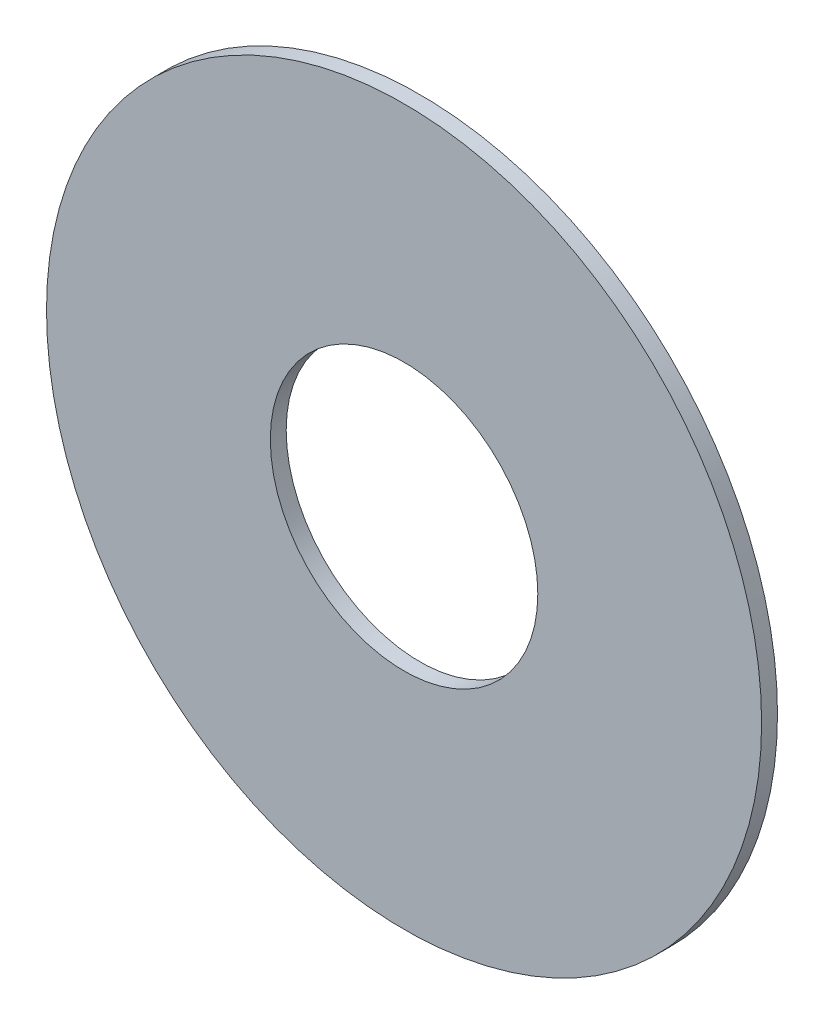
ISO-10303-21;
HEADER;
FILE_DESCRIPTION(('STEP AP214'),'2;1');
FILE_NAME('part.step','',(''),(''),'','','');
FILE_SCHEMA(('AUTOMOTIVE_DESIGN { 1 0 10303 214 1 1 1 1 }'));
ENDSEC;
DATA;
#1=APPLICATION_CONTEXT('core data for automotive mechanical design processes');
#2=APPLICATION_PROTOCOL_DEFINITION('international standard','automotive_design',2000,#1);
#3=PRODUCT_CONTEXT('',#1,'mechanical');
#4=PRODUCT('Part','Part','',(#3));
#5=PRODUCT_RELATED_PRODUCT_CATEGORY('part','',(#4));
#6=PRODUCT_DEFINITION_FORMATION('','',#4);
#7=PRODUCT_DEFINITION_CONTEXT('part definition',#1,'design');
#8=PRODUCT_DEFINITION('design','',#6,#7);
#9=PRODUCT_DEFINITION_SHAPE('','',#8);
#10=(LENGTH_UNIT() NAMED_UNIT(*) SI_UNIT(.MILLI.,.METRE.));
#11=(NAMED_UNIT(*) PLANE_ANGLE_UNIT() SI_UNIT($,.RADIAN.));
#12=(NAMED_UNIT(*) SI_UNIT($,.STERADIAN.) SOLID_ANGLE_UNIT());
#13=UNCERTAINTY_MEASURE_WITH_UNIT(LENGTH_MEASURE(1.E-05),#10,'distance_accuracy_value','');
#14=(GEOMETRIC_REPRESENTATION_CONTEXT(3) GLOBAL_UNCERTAINTY_ASSIGNED_CONTEXT((#13)) GLOBAL_UNIT_ASSIGNED_CONTEXT((#10,
#11,#12)) REPRESENTATION_CONTEXT('',''));
#15=CARTESIAN_POINT('',(0.,0.,0.));
#16=DIRECTION('',(0.,0.,1.));
#17=DIRECTION('',(1.,0.,0.));
#18=AXIS2_PLACEMENT_3D('',#15,#16,#17);
#19=CARTESIAN_POINT('',(0.,0.,0.762));
#20=DIRECTION('',(0.,0.,1.));
#21=DIRECTION('',(1.,0.,0.));
#22=AXIS2_PLACEMENT_3D('',#19,#20,#21);
#23=PLANE('',#22);
#24=CARTESIAN_POINT('',(0.,0.,0.762));
#25=DIRECTION('',(0.,0.,1.));
#26=DIRECTION('',(1.,0.,0.));
#27=AXIS2_PLACEMENT_3D('',#24,#25,#26);
#28=CIRCLE('',#27,17.145);
#29=CARTESIAN_POINT('',(-17.145,0.,0.762));
#30=VERTEX_POINT('',#29);
#31=EDGE_CURVE('E10',#30,#30,#28,.T.);
#32=ORIENTED_EDGE('',*,*,#31,.T.);
#33=EDGE_LOOP('',(#32));
#34=FACE_BOUND('',#33,.T.);
#35=CARTESIAN_POINT('',(0.,0.,0.762));
#36=DIRECTION('',(0.,0.,1.));
#37=DIRECTION('',(1.,0.,0.));
#38=AXIS2_PLACEMENT_3D('',#35,#36,#37);
#39=CIRCLE('',#38,6.4135);
#40=CARTESIAN_POINT('',(-6.4135,0.,0.762));
#41=VERTEX_POINT('',#40);
#42=EDGE_CURVE('E48',#41,#41,#39,.T.);
#43=ORIENTED_EDGE('',*,*,#42,.F.);
#44=EDGE_LOOP('',(#43));
#45=FACE_BOUND('',#44,.T.);
#46=ADVANCED_FACE('F37',(#34,#45),#23,.T.);
#47=CARTESIAN_POINT('',(0.,0.,0.));
#48=DIRECTION('',(0.,0.,1.));
#49=DIRECTION('',(1.,0.,0.));
#50=AXIS2_PLACEMENT_3D('',#47,#48,#49);
#51=PLANE('',#50);
#52=CARTESIAN_POINT('',(0.,0.,0.));
#53=DIRECTION('',(0.,0.,1.));
#54=DIRECTION('',(1.,0.,0.));
#55=AXIS2_PLACEMENT_3D('',#52,#53,#54);
#56=CIRCLE('',#55,17.145);
#57=CARTESIAN_POINT('',(-17.145,0.,0.));
#58=VERTEX_POINT('',#57);
#59=EDGE_CURVE('E44',#58,#58,#56,.T.);
#60=ORIENTED_EDGE('',*,*,#59,.F.);
#61=EDGE_LOOP('',(#60));
#62=FACE_BOUND('',#61,.T.);
#63=CARTESIAN_POINT('',(0.,0.,0.));
#64=DIRECTION('',(0.,0.,1.));
#65=DIRECTION('',(1.,0.,0.));
#66=AXIS2_PLACEMENT_3D('',#63,#64,#65);
#67=CIRCLE('',#66,6.4135);
#68=CARTESIAN_POINT('',(-6.4135,0.,0.));
#69=VERTEX_POINT('',#68);
#70=EDGE_CURVE('E52',#69,#69,#67,.T.);
#71=ORIENTED_EDGE('',*,*,#70,.T.);
#72=EDGE_LOOP('',(#71));
#73=FACE_BOUND('',#72,.T.);
#74=ADVANCED_FACE('F58',(#62,#73),#51,.F.);
#75=CARTESIAN_POINT('',(0.,0.,0.762));
#76=DIRECTION('',(0.,0.,-1.));
#77=DIRECTION('',(-1.,0.,0.));
#78=AXIS2_PLACEMENT_3D('',#75,#76,#77);
#79=CYLINDRICAL_SURFACE('',#78,17.145);
#80=CARTESIAN_POINT('',(-17.145,0.,0.762));
#81=CARTESIAN_POINT('',(-17.145,0.,0.7540625));
#82=CARTESIAN_POINT('',(-17.145,0.,0.746125));
#83=CARTESIAN_POINT('',(-17.145,0.,0.73025));
#84=CARTESIAN_POINT('',(-17.145,0.,0.7223125));
#85=CARTESIAN_POINT('',(-17.145,0.,0.7064375));
#86=CARTESIAN_POINT('',(-17.145,0.,0.6985));
#87=CARTESIAN_POINT('',(-17.145,0.,0.682625));
#88=CARTESIAN_POINT('',(-17.145,0.,0.6746875));
#89=CARTESIAN_POINT('',(-17.145,0.,0.6588125));
#90=CARTESIAN_POINT('',(-17.145,0.,0.650875));
#91=CARTESIAN_POINT('',(-17.145,0.,0.635));
#92=CARTESIAN_POINT('',(-17.145,0.,0.6270625));
#93=CARTESIAN_POINT('',(-17.145,0.,0.6111875));
#94=CARTESIAN_POINT('',(-17.145,0.,0.60325));
#95=CARTESIAN_POINT('',(-17.145,0.,0.587375));
#96=CARTESIAN_POINT('',(-17.145,0.,0.5794375));
#97=CARTESIAN_POINT('',(-17.145,0.,0.5635625));
#98=CARTESIAN_POINT('',(-17.145,0.,0.555625));
#99=CARTESIAN_POINT('',(-17.145,0.,0.53975));
#100=CARTESIAN_POINT('',(-17.145,0.,0.5318125));
#101=CARTESIAN_POINT('',(-17.145,0.,0.5159375));
#102=CARTESIAN_POINT('',(-17.145,0.,0.508));
#103=CARTESIAN_POINT('',(-17.145,0.,0.492125));
#104=CARTESIAN_POINT('',(-17.145,0.,0.4841875));
#105=CARTESIAN_POINT('',(-17.145,0.,0.4683125));
#106=CARTESIAN_POINT('',(-17.145,0.,0.460375));
#107=CARTESIAN_POINT('',(-17.145,0.,0.4445));
#108=CARTESIAN_POINT('',(-17.145,0.,0.4365625));
#109=CARTESIAN_POINT('',(-17.145,0.,0.4206875));
#110=CARTESIAN_POINT('',(-17.145,0.,0.41275));
#111=CARTESIAN_POINT('',(-17.145,0.,0.396875));
#112=CARTESIAN_POINT('',(-17.145,0.,0.3889375));
#113=CARTESIAN_POINT('',(-17.145,0.,0.3730625));
#114=CARTESIAN_POINT('',(-17.145,0.,0.365125));
#115=CARTESIAN_POINT('',(-17.145,0.,0.34925));
#116=CARTESIAN_POINT('',(-17.145,0.,0.3413125));
#117=CARTESIAN_POINT('',(-17.145,0.,0.3254375));
#118=CARTESIAN_POINT('',(-17.145,0.,0.3175));
#119=CARTESIAN_POINT('',(-17.145,0.,0.301625));
#120=CARTESIAN_POINT('',(-17.145,0.,0.2936875));
#121=CARTESIAN_POINT('',(-17.145,0.,0.2778125));
#122=CARTESIAN_POINT('',(-17.145,0.,0.269875));
#123=CARTESIAN_POINT('',(-17.145,0.,0.254));
#124=CARTESIAN_POINT('',(-17.145,0.,0.2460625));
#125=CARTESIAN_POINT('',(-17.145,0.,0.2301875));
#126=CARTESIAN_POINT('',(-17.145,0.,0.22225));
#127=CARTESIAN_POINT('',(-17.145,0.,0.206375));
#128=CARTESIAN_POINT('',(-17.145,0.,0.1984375));
#129=CARTESIAN_POINT('',(-17.145,0.,0.1825625));
#130=CARTESIAN_POINT('',(-17.145,0.,0.174625));
#131=CARTESIAN_POINT('',(-17.145,0.,0.15875));
#132=CARTESIAN_POINT('',(-17.145,0.,0.1508125));
#133=CARTESIAN_POINT('',(-17.145,0.,0.1349375));
#134=CARTESIAN_POINT('',(-17.145,0.,0.127));
#135=CARTESIAN_POINT('',(-17.145,0.,0.111125));
#136=CARTESIAN_POINT('',(-17.145,0.,0.1031875));
#137=CARTESIAN_POINT('',(-17.145,0.,0.0873125));
#138=CARTESIAN_POINT('',(-17.145,0.,0.079375));
#139=CARTESIAN_POINT('',(-17.145,0.,0.0635));
#140=CARTESIAN_POINT('',(-17.145,0.,0.0555625));
#141=CARTESIAN_POINT('',(-17.145,0.,0.0396875));
#142=CARTESIAN_POINT('',(-17.145,0.,0.03175));
#143=CARTESIAN_POINT('',(-17.145,0.,0.015875));
#144=CARTESIAN_POINT('',(-17.145,0.,0.00793749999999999));
#145=CARTESIAN_POINT('',(-17.145,0.,0.));
#146=B_SPLINE_CURVE_WITH_KNOTS('',3,(#80,#81,#82,#83,#84,#85,#86,#87,#88,#89,#90,#91,#92,#93,
#94,#95,#96,#97,#98,#99,#100,#101,#102,#103,#104,#105,#106,#107,#108,#109,#110,#111,#112,#113,
#114,#115,#116,#117,#118,#119,#120,#121,#122,#123,#124,#125,#126,#127,#128,#129,#130,#131,#132,
#133,#134,#135,#136,#137,#138,#139,#140,#141,#142,#143,#144,#145),.UNSPECIFIED.,.F.,.F.,(4,2,2,
2,2,2,2,2,2,2,2,2,2,2,2,2,2,2,2,2,2,2,2,2,2,2,2,2,2,2,2,2,4),(0.,0.0238125,0.0476249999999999,
0.0714374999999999,0.09525,0.1190625,0.142875,0.1666875,0.1905,0.2143125,0.238125,0.2619375,
0.28575,0.3095625,0.333375,0.3571875,0.381,0.4048125,0.428625,0.4524375,0.47625,0.5000625,
0.523875,0.5476875,0.5715,0.5953125,0.619125,0.6429375,0.66675,0.6905625,0.714375,0.7381875,
0.762),.UNSPECIFIED.);
#147=EDGE_CURVE('BSEAM39',#30,#58,#146,.T.);
#148=ORIENTED_EDGE('',*,*,#31,.F.);
#149=ORIENTED_EDGE('',*,*,#59,.T.);
#150=ORIENTED_EDGE('',*,*,#147,.T.);
#151=ORIENTED_EDGE('',*,*,#147,.F.);
#152=EDGE_LOOP('',(#148,#150,#149,#151));
#153=FACE_BOUND('',#152,.T.);
#154=ADVANCED_FACE('F39',(#153),#79,.T.);
#155=CARTESIAN_POINT('',(0.,0.,0.762));
#156=DIRECTION('',(0.,0.,-1.));
#157=DIRECTION('',(-1.,0.,0.));
#158=AXIS2_PLACEMENT_3D('',#155,#156,#157);
#159=CYLINDRICAL_SURFACE('',#158,6.4135);
#160=CARTESIAN_POINT('',(-6.4135,0.,0.762));
#161=CARTESIAN_POINT('',(-6.4135,0.,0.7540625));
#162=CARTESIAN_POINT('',(-6.4135,0.,0.746125));
#163=CARTESIAN_POINT('',(-6.4135,0.,0.73025));
#164=CARTESIAN_POINT('',(-6.4135,0.,0.7223125));
#165=CARTESIAN_POINT('',(-6.4135,0.,0.7064375));
#166=CARTESIAN_POINT('',(-6.4135,0.,0.6985));
#167=CARTESIAN_POINT('',(-6.4135,0.,0.682625));
#168=CARTESIAN_POINT('',(-6.4135,0.,0.6746875));
#169=CARTESIAN_POINT('',(-6.4135,0.,0.6588125));
#170=CARTESIAN_POINT('',(-6.4135,0.,0.650875));
#171=CARTESIAN_POINT('',(-6.4135,0.,0.635));
#172=CARTESIAN_POINT('',(-6.4135,0.,0.6270625));
#173=CARTESIAN_POINT('',(-6.4135,0.,0.6111875));
#174=CARTESIAN_POINT('',(-6.4135,0.,0.60325));
#175=CARTESIAN_POINT('',(-6.4135,0.,0.587375));
#176=CARTESIAN_POINT('',(-6.4135,0.,0.5794375));
#177=CARTESIAN_POINT('',(-6.4135,0.,0.5635625));
#178=CARTESIAN_POINT('',(-6.4135,0.,0.555625));
#179=CARTESIAN_POINT('',(-6.4135,0.,0.53975));
#180=CARTESIAN_POINT('',(-6.4135,0.,0.5318125));
#181=CARTESIAN_POINT('',(-6.4135,0.,0.5159375));
#182=CARTESIAN_POINT('',(-6.4135,0.,0.508));
#183=CARTESIAN_POINT('',(-6.4135,0.,0.492125));
#184=CARTESIAN_POINT('',(-6.4135,0.,0.4841875));
#185=CARTESIAN_POINT('',(-6.4135,0.,0.4683125));
#186=CARTESIAN_POINT('',(-6.4135,0.,0.460375));
#187=CARTESIAN_POINT('',(-6.4135,0.,0.4445));
#188=CARTESIAN_POINT('',(-6.4135,0.,0.4365625));
#189=CARTESIAN_POINT('',(-6.4135,0.,0.4206875));
#190=CARTESIAN_POINT('',(-6.4135,0.,0.41275));
#191=CARTESIAN_POINT('',(-6.4135,0.,0.396875));
#192=CARTESIAN_POINT('',(-6.4135,0.,0.3889375));
#193=CARTESIAN_POINT('',(-6.4135,0.,0.3730625));
#194=CARTESIAN_POINT('',(-6.4135,0.,0.365125));
#195=CARTESIAN_POINT('',(-6.4135,0.,0.34925));
#196=CARTESIAN_POINT('',(-6.4135,0.,0.3413125));
#197=CARTESIAN_POINT('',(-6.4135,0.,0.3254375));
#198=CARTESIAN_POINT('',(-6.4135,0.,0.3175));
#199=CARTESIAN_POINT('',(-6.4135,0.,0.301625));
#200=CARTESIAN_POINT('',(-6.4135,0.,0.2936875));
#201=CARTESIAN_POINT('',(-6.4135,0.,0.2778125));
#202=CARTESIAN_POINT('',(-6.4135,0.,0.269875));
#203=CARTESIAN_POINT('',(-6.4135,0.,0.254));
#204=CARTESIAN_POINT('',(-6.4135,0.,0.2460625));
#205=CARTESIAN_POINT('',(-6.4135,0.,0.2301875));
#206=CARTESIAN_POINT('',(-6.4135,0.,0.22225));
#207=CARTESIAN_POINT('',(-6.4135,0.,0.206375));
#208=CARTESIAN_POINT('',(-6.4135,0.,0.1984375));
#209=CARTESIAN_POINT('',(-6.4135,0.,0.1825625));
#210=CARTESIAN_POINT('',(-6.4135,0.,0.174625));
#211=CARTESIAN_POINT('',(-6.4135,0.,0.15875));
#212=CARTESIAN_POINT('',(-6.4135,0.,0.1508125));
#213=CARTESIAN_POINT('',(-6.4135,0.,0.1349375));
#214=CARTESIAN_POINT('',(-6.4135,0.,0.127));
#215=CARTESIAN_POINT('',(-6.4135,0.,0.111125));
#216=CARTESIAN_POINT('',(-6.4135,0.,0.1031875));
#217=CARTESIAN_POINT('',(-6.4135,0.,0.0873125));
#218=CARTESIAN_POINT('',(-6.4135,0.,0.079375));
#219=CARTESIAN_POINT('',(-6.4135,0.,0.0635));
#220=CARTESIAN_POINT('',(-6.4135,0.,0.0555625));
#221=CARTESIAN_POINT('',(-6.4135,0.,0.0396875));
#222=CARTESIAN_POINT('',(-6.4135,0.,0.03175));
#223=CARTESIAN_POINT('',(-6.4135,0.,0.015875));
#224=CARTESIAN_POINT('',(-6.4135,0.,0.00793749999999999));
#225=CARTESIAN_POINT('',(-6.4135,0.,0.));
#226=B_SPLINE_CURVE_WITH_KNOTS('',3,(#160,#161,#162,#163,#164,#165,#166,#167,#168,#169,#170,
#171,#172,#173,#174,#175,#176,#177,#178,#179,#180,#181,#182,#183,#184,#185,#186,#187,#188,#189,
#190,#191,#192,#193,#194,#195,#196,#197,#198,#199,#200,#201,#202,#203,#204,#205,#206,#207,#208,
#209,#210,#211,#212,#213,#214,#215,#216,#217,#218,#219,#220,#221,#222,#223,#224,#225),
.UNSPECIFIED.,.F.,.F.,(4,2,2,2,2,2,2,2,2,2,2,2,2,2,2,2,2,2,2,2,2,2,2,2,2,2,2,2,2,2,2,2,4),(0.,
0.0238125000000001,0.047625,0.0714375,0.0952500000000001,0.1190625,0.142875,0.1666875,0.1905,
0.2143125,0.238125,0.2619375,0.28575,0.3095625,0.333375,0.3571875,0.381,0.4048125,0.428625,
0.4524375,0.47625,0.5000625,0.523875,0.5476875,0.5715,0.5953125,0.619125,0.6429375,0.66675,
0.6905625,0.714375,0.7381875,0.762),.UNSPECIFIED.);
#227=EDGE_CURVE('BSEAM60',#41,#69,#226,.T.);
#228=ORIENTED_EDGE('',*,*,#42,.T.);
#229=ORIENTED_EDGE('',*,*,#70,.F.);
#230=ORIENTED_EDGE('',*,*,#227,.T.);
#231=ORIENTED_EDGE('',*,*,#227,.F.);
#232=EDGE_LOOP('',(#228,#230,#229,#231));
#233=FACE_BOUND('',#232,.T.);
#234=ADVANCED_FACE('F60',(#233),#159,.F.);
#235=CLOSED_SHELL('',(#46,#74,#154,#234));
#236=MANIFOLD_SOLID_BREP('B2',#235);
#237=ADVANCED_BREP_SHAPE_REPRESENTATION('',(#18,#236),#14);
#238=SHAPE_DEFINITION_REPRESENTATION(#9,#237);
ENDSEC;
END-ISO-10303-21;
